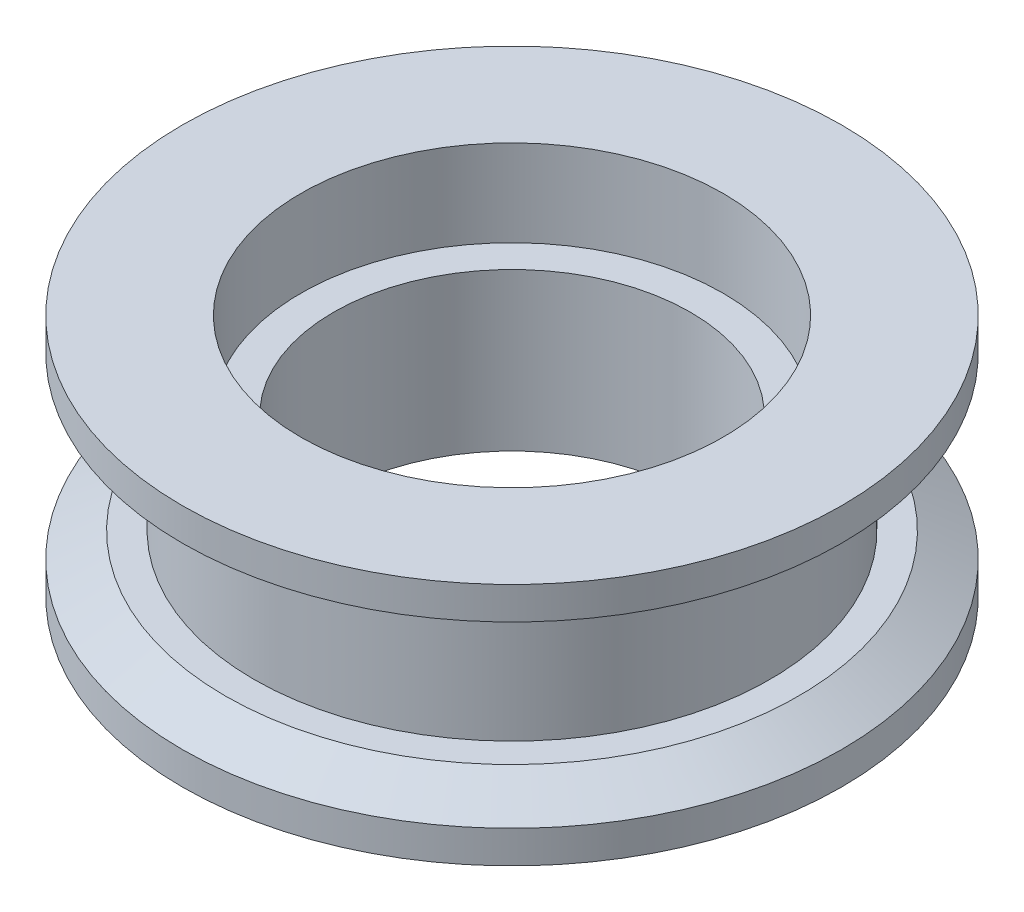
ISO-10303-21;
HEADER;
FILE_DESCRIPTION(('STEP AP214'),'2;1');
FILE_NAME('part.step','',(''),(''),'','','');
FILE_SCHEMA(('AUTOMOTIVE_DESIGN { 1 0 10303 214 1 1 1 1 }'));
ENDSEC;
DATA;
#1=APPLICATION_CONTEXT('core data for automotive mechanical design processes');
#2=APPLICATION_PROTOCOL_DEFINITION('international standard','automotive_design',2000,#1);
#3=PRODUCT_CONTEXT('',#1,'mechanical');
#4=PRODUCT('Part','Part','',(#3));
#5=PRODUCT_RELATED_PRODUCT_CATEGORY('part','',(#4));
#6=PRODUCT_DEFINITION_FORMATION('','',#4);
#7=PRODUCT_DEFINITION_CONTEXT('part definition',#1,'design');
#8=PRODUCT_DEFINITION('design','',#6,#7);
#9=PRODUCT_DEFINITION_SHAPE('','',#8);
#10=(LENGTH_UNIT() NAMED_UNIT(*) SI_UNIT(.MILLI.,.METRE.));
#11=(NAMED_UNIT(*) PLANE_ANGLE_UNIT() SI_UNIT($,.RADIAN.));
#12=(NAMED_UNIT(*) SI_UNIT($,.STERADIAN.) SOLID_ANGLE_UNIT());
#13=UNCERTAINTY_MEASURE_WITH_UNIT(LENGTH_MEASURE(1.E-05),#10,'distance_accuracy_value','');
#14=(GEOMETRIC_REPRESENTATION_CONTEXT(3) GLOBAL_UNCERTAINTY_ASSIGNED_CONTEXT((#13)) GLOBAL_UNIT_ASSIGNED_CONTEXT((#10,
#11,#12)) REPRESENTATION_CONTEXT('',''));
#15=CARTESIAN_POINT('',(0.,0.,0.));
#16=DIRECTION('',(0.,0.,1.));
#17=DIRECTION('',(1.,0.,0.));
#18=AXIS2_PLACEMENT_3D('',#15,#16,#17);
#19=CARTESIAN_POINT('',(380.27718676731,-812.8,-264.));
#20=DIRECTION('',(0.,1.,0.));
#21=DIRECTION('',(0.,0.,1.));
#22=AXIS2_PLACEMENT_3D('',#19,#20,#21);
#23=CYLINDRICAL_SURFACE('',#22,6.22299999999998);
#24=CARTESIAN_POINT('',(380.27718676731,8.00000000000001,-264.));
#25=DIRECTION('',(0.,1.,0.));
#26=DIRECTION('',(0.,0.,1.));
#27=AXIS2_PLACEMENT_3D('',#24,#25,#26);
#28=CIRCLE('',#27,6.22299999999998);
#29=CARTESIAN_POINT('',(380.27718676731,8.00000000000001,-257.777));
#30=VERTEX_POINT('',#29);
#31=EDGE_CURVE('E62',#30,#30,#28,.T.);
#32=ORIENTED_EDGE('',*,*,#31,.F.);
#33=EDGE_LOOP('',(#32));
#34=FACE_BOUND('',#33,.T.);
#35=CARTESIAN_POINT('',(380.27718676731,13.4840000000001,-264.));
#36=DIRECTION('',(0.,1.,0.));
#37=DIRECTION('',(0.,0.,1.));
#38=AXIS2_PLACEMENT_3D('',#35,#36,#37);
#39=CIRCLE('',#38,6.22299999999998);
#40=CARTESIAN_POINT('',(380.27718676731,13.4840000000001,-257.777));
#41=VERTEX_POINT('',#40);
#42=EDGE_CURVE('E34',#41,#41,#39,.F.);
#43=ORIENTED_EDGE('',*,*,#42,.F.);
#44=EDGE_LOOP('',(#43));
#45=FACE_BOUND('',#44,.T.);
#46=ADVANCED_FACE('F30',(#34,#45),#23,.F.);
#47=CARTESIAN_POINT('',(380.27718676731,10.,-264.));
#48=DIRECTION('',(0.,1.,0.));
#49=DIRECTION('',(0.,0.,1.));
#50=AXIS2_PLACEMENT_3D('',#47,#48,#49);
#51=PLANE('',#50);
#52=CARTESIAN_POINT('',(380.27718676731,10.,-264.));
#53=DIRECTION('',(0.,1.,0.));
#54=DIRECTION('',(0.,0.,1.));
#55=AXIS2_PLACEMENT_3D('',#52,#53,#54);
#56=CIRCLE('',#55,10.);
#57=CARTESIAN_POINT('',(380.27718676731,10.,-254.));
#58=VERTEX_POINT('',#57);
#59=EDGE_CURVE('E47',#58,#58,#56,.T.);
#60=ORIENTED_EDGE('',*,*,#59,.T.);
#61=EDGE_LOOP('',(#60));
#62=FACE_BOUND('',#61,.T.);
#63=CARTESIAN_POINT('',(380.27718676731,10.,-264.));
#64=DIRECTION('',(0.,1.,0.));
#65=DIRECTION('',(0.,0.,1.));
#66=AXIS2_PLACEMENT_3D('',#63,#64,#65);
#67=CIRCLE('',#66,8.99999999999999);
#68=CARTESIAN_POINT('',(380.27718676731,10.,-255.));
#69=VERTEX_POINT('',#68);
#70=EDGE_CURVE('E54',#69,#69,#67,.T.);
#71=ORIENTED_EDGE('',*,*,#70,.F.);
#72=EDGE_LOOP('',(#71));
#73=FACE_BOUND('',#72,.T.);
#74=ADVANCED_FACE('F93',(#62,#73),#51,.T.);
#75=CARTESIAN_POINT('',(380.27718676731,10.,-264.));
#76=DIRECTION('',(0.,-1.,0.));
#77=DIRECTION('',(0.,0.,-1.));
#78=AXIS2_PLACEMENT_3D('',#75,#76,#77);
#79=CYLINDRICAL_SURFACE('',#78,11.5);
#80=CARTESIAN_POINT('',(380.27718676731,9.13397459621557,-264.));
#81=DIRECTION('',(0.,1.,0.));
#82=DIRECTION('',(0.,0.,1.));
#83=AXIS2_PLACEMENT_3D('',#80,#81,#82);
#84=CIRCLE('',#83,11.5);
#85=CARTESIAN_POINT('',(380.27718676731,9.13397459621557,-252.5));
#86=VERTEX_POINT('',#85);
#87=EDGE_CURVE('E42',#86,#86,#84,.F.);
#88=ORIENTED_EDGE('',*,*,#87,.T.);
#89=EDGE_LOOP('',(#88));
#90=FACE_BOUND('',#89,.T.);
#91=CARTESIAN_POINT('',(380.27718676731,8.,-264.));
#92=DIRECTION('',(0.,1.,0.));
#93=DIRECTION('',(0.,0.,1.));
#94=AXIS2_PLACEMENT_3D('',#91,#92,#93);
#95=CIRCLE('',#94,11.5);
#96=CARTESIAN_POINT('',(380.27718676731,8.,-252.5));
#97=VERTEX_POINT('',#96);
#98=EDGE_CURVE('E50',#97,#97,#95,.T.);
#99=ORIENTED_EDGE('',*,*,#98,.T.);
#100=EDGE_LOOP('',(#99));
#101=FACE_BOUND('',#100,.T.);
#102=ADVANCED_FACE('F99',(#90,#101),#79,.T.);
#103=CARTESIAN_POINT('',(380.27718676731,8.,-264.));
#104=DIRECTION('',(0.,1.,0.));
#105=DIRECTION('',(0.,0.,1.));
#106=AXIS2_PLACEMENT_3D('',#103,#104,#105);
#107=PLANE('',#106);
#108=ORIENTED_EDGE('',*,*,#31,.T.);
#109=EDGE_LOOP('',(#108));
#110=FACE_BOUND('',#109,.T.);
#111=ORIENTED_EDGE('',*,*,#98,.F.);
#112=EDGE_LOOP('',(#111));
#113=FACE_BOUND('',#112,.T.);
#114=ADVANCED_FACE('F132',(#110,#113),#107,.F.);
#115=CARTESIAN_POINT('',(380.27718676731,14.5,-264.));
#116=DIRECTION('',(0.,-1.,0.));
#117=DIRECTION('',(0.,0.,-1.));
#118=AXIS2_PLACEMENT_3D('',#115,#116,#117);
#119=CYLINDRICAL_SURFACE('',#118,8.99999999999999);
#120=CARTESIAN_POINT('',(380.27718676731,14.5,-264.));
#121=DIRECTION('',(0.,1.,0.));
#122=DIRECTION('',(0.,0.,1.));
#123=AXIS2_PLACEMENT_3D('',#120,#121,#122);
#124=CIRCLE('',#123,8.99999999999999);
#125=CARTESIAN_POINT('',(380.27718676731,14.5,-255.));
#126=VERTEX_POINT('',#125);
#127=EDGE_CURVE('E53',#126,#126,#124,.T.);
#128=ORIENTED_EDGE('',*,*,#127,.F.);
#129=EDGE_LOOP('',(#128));
#130=FACE_BOUND('',#129,.T.);
#131=ORIENTED_EDGE('',*,*,#70,.T.);
#132=EDGE_LOOP('',(#131));
#133=FACE_BOUND('',#132,.T.);
#134=ADVANCED_FACE('F89',(#130,#133),#119,.T.);
#135=CARTESIAN_POINT('',(380.27718676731,14.5,-264.));
#136=DIRECTION('',(0.,1.,0.));
#137=DIRECTION('',(0.,0.,1.));
#138=AXIS2_PLACEMENT_3D('',#135,#136,#137);
#139=PLANE('',#138);
#140=CARTESIAN_POINT('',(380.27718676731,14.5,-264.));
#141=DIRECTION('',(0.,1.,0.));
#142=DIRECTION('',(0.,0.,1.));
#143=AXIS2_PLACEMENT_3D('',#140,#141,#142);
#144=CIRCLE('',#143,10.);
#145=CARTESIAN_POINT('',(380.27718676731,14.5,-254.));
#146=VERTEX_POINT('',#145);
#147=EDGE_CURVE('E11',#146,#146,#144,.F.);
#148=ORIENTED_EDGE('',*,*,#147,.T.);
#149=EDGE_LOOP('',(#148));
#150=FACE_BOUND('',#149,.T.);
#151=ORIENTED_EDGE('',*,*,#127,.T.);
#152=EDGE_LOOP('',(#151));
#153=FACE_BOUND('',#152,.T.);
#154=ADVANCED_FACE('F83',(#150,#153),#139,.F.);
#155=CARTESIAN_POINT('',(380.27718676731,16.5,-264.));
#156=DIRECTION('',(0.,-1.,0.));
#157=DIRECTION('',(0.,0.,-1.));
#158=AXIS2_PLACEMENT_3D('',#155,#156,#157);
#159=CYLINDRICAL_SURFACE('',#158,11.5);
#160=CARTESIAN_POINT('',(380.27718676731,15.3660254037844,-264.));
#161=DIRECTION('',(0.,1.,0.));
#162=DIRECTION('',(0.,0.,1.));
#163=AXIS2_PLACEMENT_3D('',#160,#161,#162);
#164=CIRCLE('',#163,11.5);
#165=CARTESIAN_POINT('',(380.27718676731,15.3660254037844,-252.5));
#166=VERTEX_POINT('',#165);
#167=EDGE_CURVE('E38',#166,#166,#164,.T.);
#168=ORIENTED_EDGE('',*,*,#167,.T.);
#169=EDGE_LOOP('',(#168));
#170=FACE_BOUND('',#169,.T.);
#171=CARTESIAN_POINT('',(380.27718676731,16.5,-264.));
#172=DIRECTION('',(0.,1.,0.));
#173=DIRECTION('',(0.,0.,1.));
#174=AXIS2_PLACEMENT_3D('',#171,#172,#173);
#175=CIRCLE('',#174,11.5);
#176=CARTESIAN_POINT('',(380.27718676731,16.5,-252.5));
#177=VERTEX_POINT('',#176);
#178=EDGE_CURVE('E57',#177,#177,#175,.T.);
#179=ORIENTED_EDGE('',*,*,#178,.F.);
#180=EDGE_LOOP('',(#179));
#181=FACE_BOUND('',#180,.T.);
#182=ADVANCED_FACE('F78',(#170,#181),#159,.T.);
#183=CARTESIAN_POINT('',(380.27718676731,16.5,-264.));
#184=DIRECTION('',(0.,1.,0.));
#185=DIRECTION('',(0.,0.,1.));
#186=AXIS2_PLACEMENT_3D('',#183,#184,#185);
#187=PLANE('',#186);
#188=CARTESIAN_POINT('',(380.27718676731,16.5,-264.));
#189=DIRECTION('',(0.,1.,0.));
#190=DIRECTION('',(0.,0.,1.));
#191=AXIS2_PLACEMENT_3D('',#188,#189,#190);
#192=CIRCLE('',#191,7.36599999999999);
#193=CARTESIAN_POINT('',(380.27718676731,16.5,-256.634));
#194=VERTEX_POINT('',#193);
#195=EDGE_CURVE('E68',#194,#194,#192,.T.);
#196=ORIENTED_EDGE('',*,*,#195,.F.);
#197=EDGE_LOOP('',(#196));
#198=FACE_BOUND('',#197,.T.);
#199=ORIENTED_EDGE('',*,*,#178,.T.);
#200=EDGE_LOOP('',(#199));
#201=FACE_BOUND('',#200,.T.);
#202=ADVANCED_FACE('F74',(#198,#201),#187,.T.);
#203=CARTESIAN_POINT('',(380.27718676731,10.,-264.));
#204=DIRECTION('',(0.,-1.,0.));
#205=DIRECTION('',(0.,0.,-1.));
#206=AXIS2_PLACEMENT_3D('',#203,#204,#205);
#207=CONICAL_SURFACE('',#206,10.,1.0471975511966);
#208=ORIENTED_EDGE('',*,*,#87,.F.);
#209=EDGE_LOOP('',(#208));
#210=FACE_BOUND('',#209,.T.);
#211=ORIENTED_EDGE('',*,*,#59,.F.);
#212=EDGE_LOOP('',(#211));
#213=FACE_BOUND('',#212,.T.);
#214=ADVANCED_FACE('F77',(#210,#213),#207,.T.);
#215=CARTESIAN_POINT('',(380.27718676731,15.3660254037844,-264.));
#216=DIRECTION('',(0.,1.,0.));
#217=DIRECTION('',(0.,0.,1.));
#218=AXIS2_PLACEMENT_3D('',#215,#216,#217);
#219=CONICAL_SURFACE('',#218,11.5,1.0471975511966);
#220=ORIENTED_EDGE('',*,*,#147,.F.);
#221=EDGE_LOOP('',(#220));
#222=FACE_BOUND('',#221,.T.);
#223=ORIENTED_EDGE('',*,*,#167,.F.);
#224=EDGE_LOOP('',(#223));
#225=FACE_BOUND('',#224,.T.);
#226=ADVANCED_FACE('F32',(#222,#225),#219,.T.);
#227=CARTESIAN_POINT('',(-30.,13.484,286.));
#228=DIRECTION('',(0.,1.,0.));
#229=DIRECTION('',(0.,0.,1.));
#230=AXIS2_PLACEMENT_3D('',#227,#228,#229);
#231=PLANE('',#230);
#232=CARTESIAN_POINT('',(380.27718676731,13.484,-264.));
#233=DIRECTION('',(0.,1.,0.));
#234=DIRECTION('',(0.,0.,1.));
#235=AXIS2_PLACEMENT_3D('',#232,#233,#234);
#236=CIRCLE('',#235,7.36599999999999);
#237=CARTESIAN_POINT('',(380.27718676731,13.484,-256.634));
#238=VERTEX_POINT('',#237);
#239=EDGE_CURVE('E65',#238,#238,#236,.F.);
#240=ORIENTED_EDGE('',*,*,#239,.F.);
#241=EDGE_LOOP('',(#240));
#242=FACE_BOUND('',#241,.T.);
#243=ORIENTED_EDGE('',*,*,#42,.T.);
#244=EDGE_LOOP('',(#243));
#245=FACE_BOUND('',#244,.T.);
#246=ADVANCED_FACE('F107',(#242,#245),#231,.T.);
#247=CARTESIAN_POINT('',(380.27718676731,-8.3661942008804,-264.));
#248=DIRECTION('',(0.,1.,0.));
#249=DIRECTION('',(0.,0.,1.));
#250=AXIS2_PLACEMENT_3D('',#247,#248,#249);
#251=CYLINDRICAL_SURFACE('',#250,7.36599999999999);
#252=CARTESIAN_POINT('',(380.27718676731,13.484,-256.634));
#253=CARTESIAN_POINT('',(380.27718676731,13.5154166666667,-256.634));
#254=CARTESIAN_POINT('',(380.27718676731,13.5468333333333,-256.634));
#255=CARTESIAN_POINT('',(380.27718676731,13.6096666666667,-256.634));
#256=CARTESIAN_POINT('',(380.27718676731,13.6410833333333,-256.634));
#257=CARTESIAN_POINT('',(380.27718676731,13.7039166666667,-256.634));
#258=CARTESIAN_POINT('',(380.27718676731,13.7353333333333,-256.634));
#259=CARTESIAN_POINT('',(380.27718676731,13.7981666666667,-256.634));
#260=CARTESIAN_POINT('',(380.27718676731,13.8295833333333,-256.634));
#261=CARTESIAN_POINT('',(380.27718676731,13.8924166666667,-256.634));
#262=CARTESIAN_POINT('',(380.27718676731,13.9238333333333,-256.634));
#263=CARTESIAN_POINT('',(380.27718676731,13.9866666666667,-256.634));
#264=CARTESIAN_POINT('',(380.27718676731,14.0180833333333,-256.634));
#265=CARTESIAN_POINT('',(380.27718676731,14.0809166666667,-256.634));
#266=CARTESIAN_POINT('',(380.27718676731,14.1123333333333,-256.634));
#267=CARTESIAN_POINT('',(380.27718676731,14.1751666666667,-256.634));
#268=CARTESIAN_POINT('',(380.27718676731,14.2065833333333,-256.634));
#269=CARTESIAN_POINT('',(380.27718676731,14.2694166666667,-256.634));
#270=CARTESIAN_POINT('',(380.27718676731,14.3008333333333,-256.634));
#271=CARTESIAN_POINT('',(380.27718676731,14.3636666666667,-256.634));
#272=CARTESIAN_POINT('',(380.27718676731,14.3950833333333,-256.634));
#273=CARTESIAN_POINT('',(380.27718676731,14.4579166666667,-256.634));
#274=CARTESIAN_POINT('',(380.27718676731,14.4893333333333,-256.634));
#275=CARTESIAN_POINT('',(380.27718676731,14.5521666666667,-256.634));
#276=CARTESIAN_POINT('',(380.27718676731,14.5835833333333,-256.634));
#277=CARTESIAN_POINT('',(380.27718676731,14.6464166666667,-256.634));
#278=CARTESIAN_POINT('',(380.27718676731,14.6778333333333,-256.634));
#279=CARTESIAN_POINT('',(380.27718676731,14.7406666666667,-256.634));
#280=CARTESIAN_POINT('',(380.27718676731,14.7720833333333,-256.634));
#281=CARTESIAN_POINT('',(380.27718676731,14.8349166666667,-256.634));
#282=CARTESIAN_POINT('',(380.27718676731,14.8663333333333,-256.634));
#283=CARTESIAN_POINT('',(380.27718676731,14.9291666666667,-256.634));
#284=CARTESIAN_POINT('',(380.27718676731,14.9605833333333,-256.634));
#285=CARTESIAN_POINT('',(380.27718676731,15.0234166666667,-256.634));
#286=CARTESIAN_POINT('',(380.27718676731,15.0548333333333,-256.634));
#287=CARTESIAN_POINT('',(380.27718676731,15.1176666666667,-256.634));
#288=CARTESIAN_POINT('',(380.27718676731,15.1490833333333,-256.634));
#289=CARTESIAN_POINT('',(380.27718676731,15.2119166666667,-256.634));
#290=CARTESIAN_POINT('',(380.27718676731,15.2433333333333,-256.634));
#291=CARTESIAN_POINT('',(380.27718676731,15.3061666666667,-256.634));
#292=CARTESIAN_POINT('',(380.27718676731,15.3375833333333,-256.634));
#293=CARTESIAN_POINT('',(380.27718676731,15.4004166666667,-256.634));
#294=CARTESIAN_POINT('',(380.27718676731,15.4318333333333,-256.634));
#295=CARTESIAN_POINT('',(380.27718676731,15.4946666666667,-256.634));
#296=CARTESIAN_POINT('',(380.27718676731,15.5260833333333,-256.634));
#297=CARTESIAN_POINT('',(380.27718676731,15.5889166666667,-256.634));
#298=CARTESIAN_POINT('',(380.27718676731,15.6203333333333,-256.634));
#299=CARTESIAN_POINT('',(380.27718676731,15.6831666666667,-256.634));
#300=CARTESIAN_POINT('',(380.27718676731,15.7145833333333,-256.634));
#301=CARTESIAN_POINT('',(380.27718676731,15.7774166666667,-256.634));
#302=CARTESIAN_POINT('',(380.27718676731,15.8088333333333,-256.634));
#303=CARTESIAN_POINT('',(380.27718676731,15.8716666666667,-256.634));
#304=CARTESIAN_POINT('',(380.27718676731,15.9030833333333,-256.634));
#305=CARTESIAN_POINT('',(380.27718676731,15.9659166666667,-256.634));
#306=CARTESIAN_POINT('',(380.27718676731,15.9973333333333,-256.634));
#307=CARTESIAN_POINT('',(380.27718676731,16.0601666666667,-256.634));
#308=CARTESIAN_POINT('',(380.27718676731,16.0915833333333,-256.634));
#309=CARTESIAN_POINT('',(380.27718676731,16.1544166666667,-256.634));
#310=CARTESIAN_POINT('',(380.27718676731,16.1858333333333,-256.634));
#311=CARTESIAN_POINT('',(380.27718676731,16.2486666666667,-256.634));
#312=CARTESIAN_POINT('',(380.27718676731,16.2800833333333,-256.634));
#313=CARTESIAN_POINT('',(380.27718676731,16.3429166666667,-256.634));
#314=CARTESIAN_POINT('',(380.27718676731,16.3743333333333,-256.634));
#315=CARTESIAN_POINT('',(380.27718676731,16.4371666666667,-256.634));
#316=CARTESIAN_POINT('',(380.27718676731,16.4685833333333,-256.634));
#317=CARTESIAN_POINT('',(380.27718676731,16.5,-256.634));
#318=B_SPLINE_CURVE_WITH_KNOTS('',3,(#252,#253,#254,#255,#256,#257,#258,#259,#260,#261,#262,
#263,#264,#265,#266,#267,#268,#269,#270,#271,#272,#273,#274,#275,#276,#277,#278,#279,#280,#281,
#282,#283,#284,#285,#286,#287,#288,#289,#290,#291,#292,#293,#294,#295,#296,#297,#298,#299,#300,
#301,#302,#303,#304,#305,#306,#307,#308,#309,#310,#311,#312,#313,#314,#315,#316,#317),
.UNSPECIFIED.,.F.,.F.,(4,2,2,2,2,2,2,2,2,2,2,2,2,2,2,2,2,2,2,2,2,2,2,2,2,2,2,2,2,2,2,2,4),(0.,
0.0942500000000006,0.188500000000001,0.282750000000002,0.377000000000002,0.471249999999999,
0.5655,0.659750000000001,0.754000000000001,0.848250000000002,0.942500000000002,1.03675,1.131,
1.22525,1.3195,1.41375,1.508,1.60225,1.6965,1.79075,1.885,1.97925,2.0735,2.16775,2.262,2.35625,
2.4505,2.54475000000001,2.639,2.73325,2.8275,2.92175,3.016),.UNSPECIFIED.);
#319=EDGE_CURVE('BSEAM72',#238,#194,#318,.T.);
#320=ORIENTED_EDGE('',*,*,#239,.T.);
#321=ORIENTED_EDGE('',*,*,#195,.T.);
#322=ORIENTED_EDGE('',*,*,#319,.T.);
#323=ORIENTED_EDGE('',*,*,#319,.F.);
#324=EDGE_LOOP('',(#320,#322,#321,#323));
#325=FACE_BOUND('',#324,.T.);
#326=ADVANCED_FACE('F72',(#325),#251,.F.);
#327=CLOSED_SHELL('',(#46,#74,#102,#114,#134,#154,#182,#202,#214,#226,#246,#326));
#328=MANIFOLD_SOLID_BREP('B2',#327);
#329=ADVANCED_BREP_SHAPE_REPRESENTATION('',(#18,#328),#14);
#330=SHAPE_DEFINITION_REPRESENTATION(#9,#329);
ENDSEC;
END-ISO-10303-21;
